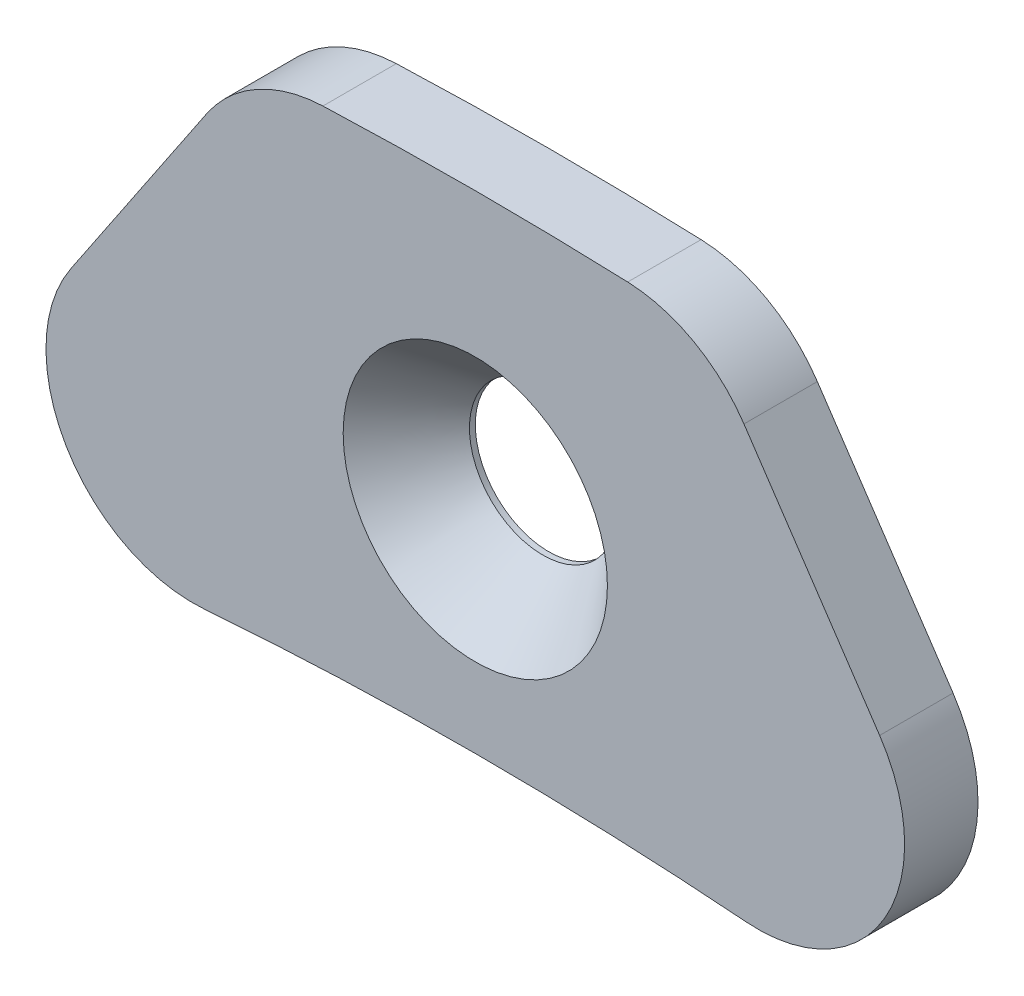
from build123d import *

# Parameters (mm, degrees)
SKETCH1_R      = 1.5875
EXTRUDE1_DEPTH = 1.5875
CHAMFER1_SIZE  = 1.27
CHAMFER1_SIZE2 = 1.460967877


with BuildPart() as part:
    # Sketch1 → Extrude1 (new body)
    with BuildSketch(Plane.XY):
        with BuildLine():
            Line((5.810114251, 85.213217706), (8.744765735, 80.846926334))
            ThreePointArc((8.744765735, 80.846926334), (8.852155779, 77.476045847), (5.865069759, 75.910260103))
            ThreePointArc((5.865069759, 75.910260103), (0, 76.1365), (-5.865069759, 75.910260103))
            ThreePointArc((-5.865069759, 75.910260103), (-8.852155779, 77.476045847), (-8.744765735, 80.846926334))
            Line((-8.744765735, 80.846926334), (-5.810114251, 85.213217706))
            ThreePointArc((-5.810114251, 85.213217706), (-4.720891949, 86.215353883), (-3.295722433, 86.614821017))
            ThreePointArc((-3.295722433, 86.614821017), (0, 86.6775), (3.295722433, 86.614821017))
            ThreePointArc((3.295722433, 86.614821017), (4.720891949, 86.215353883), (5.810114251, 85.213217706))
        make_face()
        with Locations((0, 80.7085)):
            Circle(SKETCH1_R, mode=Mode.SUBTRACT)
    extrude(amount=EXTRUDE1_DEPTH)

    # Chamfer1
    chamfer1_edges = [part.edges().sort_by_distance(p)[0] for p in [
        (-1.5875, 80.7085, 1.5875),
    ]]
    chamfer1_side = [part.faces().sort_by_distance(p)[0] for p in [
        (4.616356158, 86.027822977, 1.5875),
    ]]
    chamfer(chamfer1_edges, length=CHAMFER1_SIZE, length2=CHAMFER1_SIZE2, reference=chamfer1_side[0])


solid = part.part
